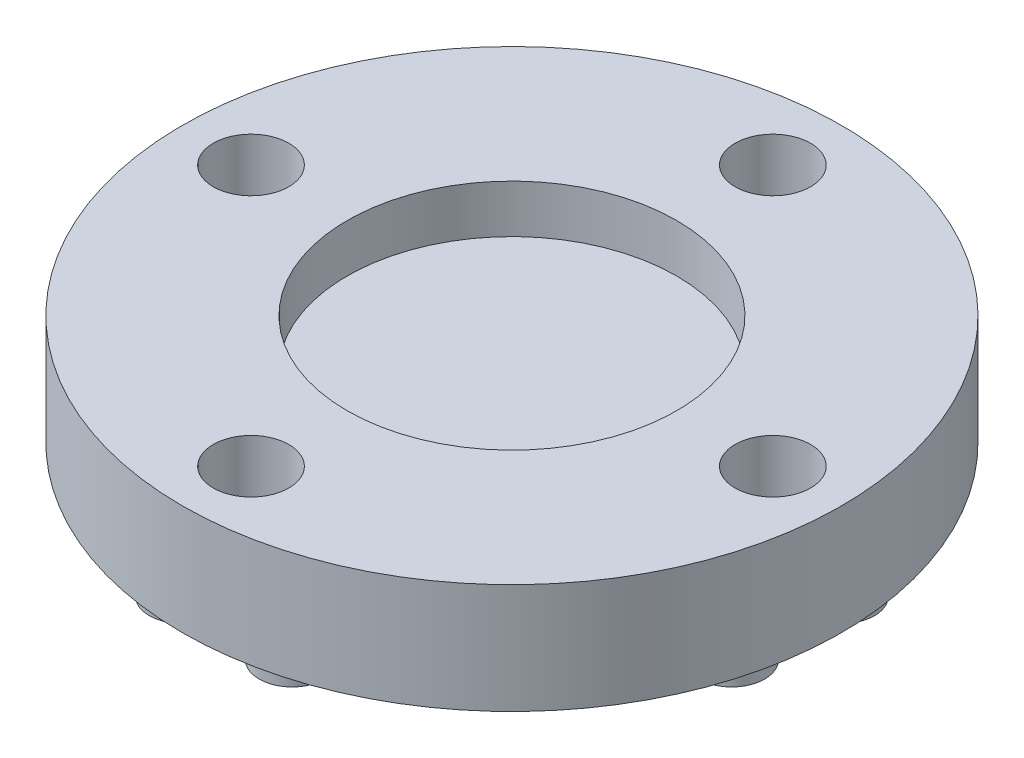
from build123d import *

# Parameters (mm, degrees)
SKETCH1_R           = 24
BOSS_EXTRUDE1_DEPTH = 8
SKETCH11_R          = 2.41
BOSS_EXTRUDE2_DEPTH = 1.72
SKETCH12_R          = 12
CUT_EXTRUDE1_DEPTH  = 3.5
SKETCH13_R          = 2.75
CUT_EXTRUDE2_DEPTH  = 5.5


with BuildPart() as part:
    # Sketch1 → Boss-Extrude1 (new body)
    with BuildSketch(Plane(origin=(0, 0, 0), x_dir=(1, 0, 0), z_dir=(0, 1, 0))):
        with Locations(Location((0, 0, 0), (0, 0, 270))):
            Circle(SKETCH1_R)
    extrude(amount=BOSS_EXTRUDE1_DEPTH)

    # Sketch11 → Boss-Extrude2 (add)
    with BuildSketch(Plane.XZ):
        with Locations(Location((-4, -20, 0), (0, 0, 90))):
            Circle(SKETCH11_R)
        with Locations(Location((4, -20, 0), (0, 0, 90))):
            Circle(SKETCH11_R)
        with Locations(Location((-12, -12, 0), (0, 0, 90))):
            Circle(SKETCH11_R)
        with Locations(Location((-4, -12, 0), (0, 0, 90))):
            Circle(SKETCH11_R)
        with Locations(Location((4, -12, 0), (0, 0, 90))):
            Circle(SKETCH11_R)
        with Locations(Location((12, -12, 0), (0, 0, 90))):
            Circle(SKETCH11_R)
        with Locations(Location((-12, -4, 0), (0, 0, 90))):
            Circle(SKETCH11_R)
        with Locations(Location((-4, -4, 0), (0, 0, 90))):
            Circle(SKETCH11_R)
        with Locations(Location((4, -4, 0), (0, 0, 90))):
            Circle(SKETCH11_R)
        with Locations(Location((12, -4, 0), (0, 0, 90))):
            Circle(SKETCH11_R)
        with Locations(Location((20, -4, 0), (0, 0, 90))):
            Circle(SKETCH11_R)
        with Locations(Location((-12, 4, 0), (0, 0, 90))):
            Circle(SKETCH11_R)
        with Locations(Location((-4, 4, 0), (0, 0, 90))):
            Circle(SKETCH11_R)
        with Locations(Location((4, 4, 0), (0, 0, 90))):
            Circle(SKETCH11_R)
        with Locations(Location((12, 4, 0), (0, 0, 90))):
            Circle(SKETCH11_R)
        with Locations(Location((20, 4, 0), (0, 0, 90))):
            Circle(SKETCH11_R)
        with Locations(Location((-12, 12, 0), (0, 0, 90))):
            Circle(SKETCH11_R)
        with Locations(Location((-4, 12, 0), (0, 0, 90))):
            Circle(SKETCH11_R)
        with Locations(Location((4, 12, 0), (0, 0, 90))):
            Circle(SKETCH11_R)
        with Locations(Location((12, 12, 0), (0, 0, 90))):
            Circle(SKETCH11_R)
        with Locations(Location((-4, 20, 0), (0, 0, 90))):
            Circle(SKETCH11_R)
        with Locations(Location((4, 20, 0), (0, 0, 90))):
            Circle(SKETCH11_R)
        with Locations(Location((-20, -4, 0), (0, 0, 90))):
            Circle(SKETCH11_R)
        with Locations(Location((-20, 4, 0), (0, 0, 90))):
            Circle(SKETCH11_R)
    extrude(amount=BOSS_EXTRUDE2_DEPTH)

    # Sketch12 → Cut-Extrude1 (cut)
    with BuildSketch(Plane(origin=(0, 8, 0), x_dir=(1, 0, 0), z_dir=(0, 1, 0))):
        with Locations(Location((0, 0, 0), (0, 0, 270))):
            Circle(SKETCH12_R)
    extrude(amount=-CUT_EXTRUDE1_DEPTH, mode=Mode.SUBTRACT)

    # Sketch13 → Cut-Extrude2 (cut)
    with BuildSketch(Plane(origin=(0, 8, 0), x_dir=(1, 0, 0), z_dir=(0, 1, 0))):
        with Locations(Location((-19, 0, 0), (0, 0, 270))):
            Circle(SKETCH13_R)
        with Locations(Location((0, 19, 0), (0, 0, 270))):
            Circle(SKETCH13_R)
        with Locations(Location((19, 0, 0), (0, 0, 270))):
            Circle(SKETCH13_R)
        with Locations(Location((0, -19, 0), (0, 0, 270))):
            Circle(SKETCH13_R)
    extrude(amount=-CUT_EXTRUDE2_DEPTH, mode=Mode.SUBTRACT)


solid = part.part
